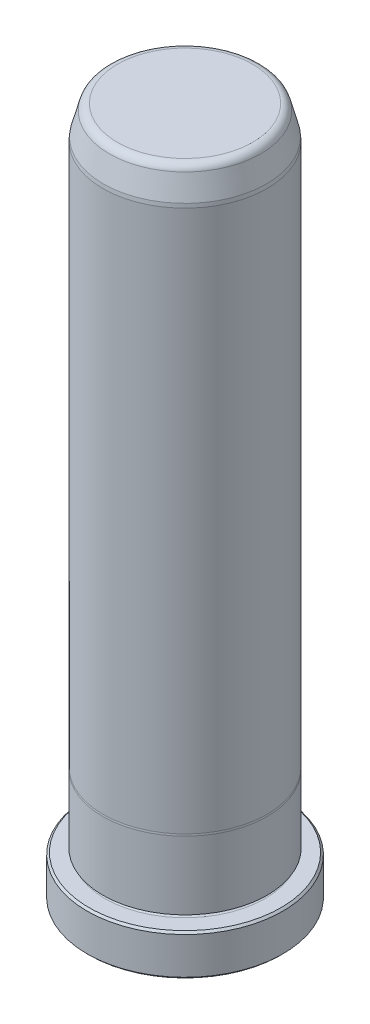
from build123d import *

# Parameters (mm, degrees)
FILLET6_R     = 1.5875
CHAMFER1_SIZE = 0.381


with BuildPart() as part:
    # Sketch1 → Revolve1 (revolve)
    with BuildSketch(Plane(origin=(0, 0, 0), x_dir=(0, 0, -1), z_dir=(1, 0, 0)), mode=Mode.PRIVATE) as revolve1_sk:
        with BuildLine():
            Line((0, 0), (18.923, 0))
            Line((18.923, 0), (18.923, 7.9248))
            Line((18.923, 7.9248), (15.4813, 7.9248))
            ThreePointArc((15.4813, 7.9248), (15.1003, 8.3058), (15.4813, 8.6868))
            Line((15.4813, 8.6868), (15.8877, 8.6868))
            Line((15.8877, 8.6868), (15.8877, 21.861763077))
            Line((15.8877, 21.861763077), (15.8623, 22.225))
            Line((15.8623, 22.225), (15.8623, 127))
            Line((15.8623, 127), (15.795633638, 127.762))
            Line((15.795633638, 127.762), (14.298333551, 133.35))
            Line((14.298333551, 133.35), (0, 133.35))
            Line((0, 133.35), (0, 0))
        make_face()
    revolve(revolve1_sk.sketch.rotate(Axis((0, 0, 0), (0, -1, 0)), 180), axis=Axis((0, 0, 0), (0, -1, 0)))

    # Fillet6
    fillet6_edges = [part.edges().sort_by_distance(p)[0] for p in [
        (0, 133.35, -14.298333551),
    ]]
    fillet(fillet6_edges, radius=FILLET6_R)

    # Chamfer1
    chamfer1_edges = [part.edges().sort_by_distance(p)[0] for p in [
        (0, 7.9248, -18.923),
        (0, 0, -18.923),
    ]]
    chamfer(chamfer1_edges, length=CHAMFER1_SIZE)


solid = part.part
